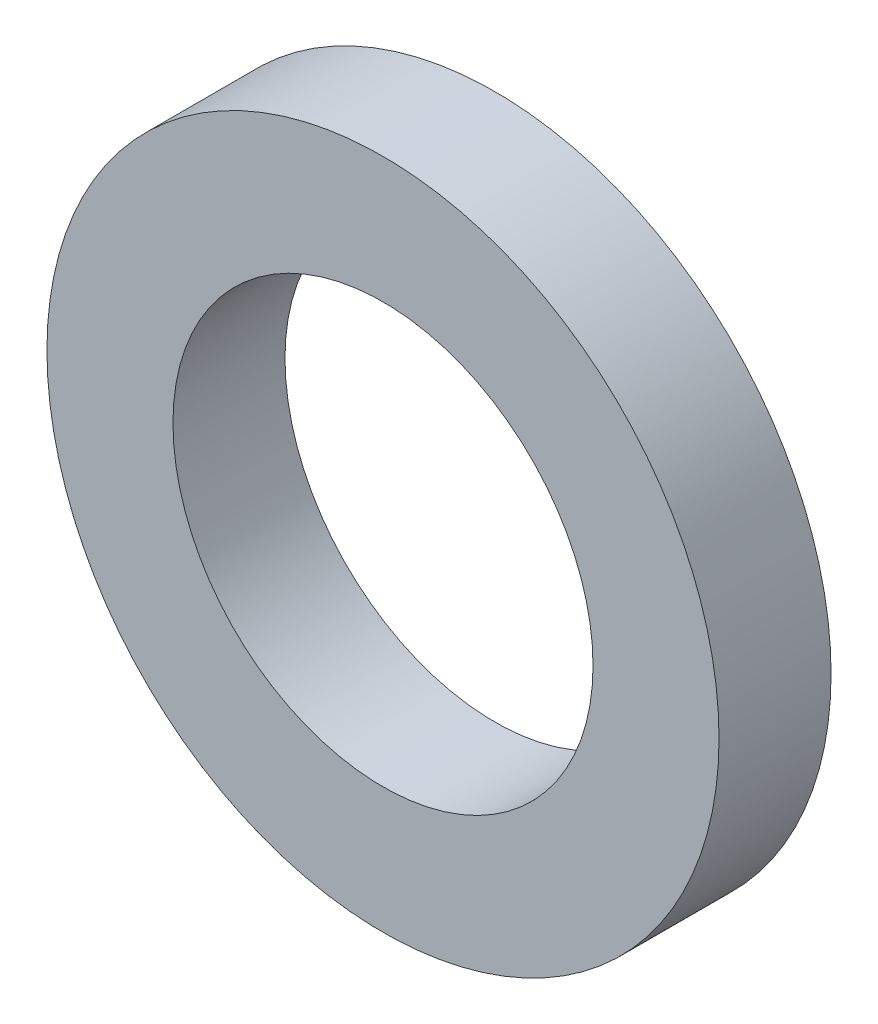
from build123d import *

# Parameters (mm, degrees)
ESQUISSE1_R      = 6
ESQUISSE1_R_2    = 3.75
EXTRUSION1_DEPTH = 2


with BuildPart() as part:
    # Esquisse1 → Extrusion1 (new body)
    with BuildSketch(Plane.XY):
        Circle(ESQUISSE1_R)
        Circle(ESQUISSE1_R_2, mode=Mode.SUBTRACT)
    extrude(amount=-EXTRUSION1_DEPTH)


solid = part.part
